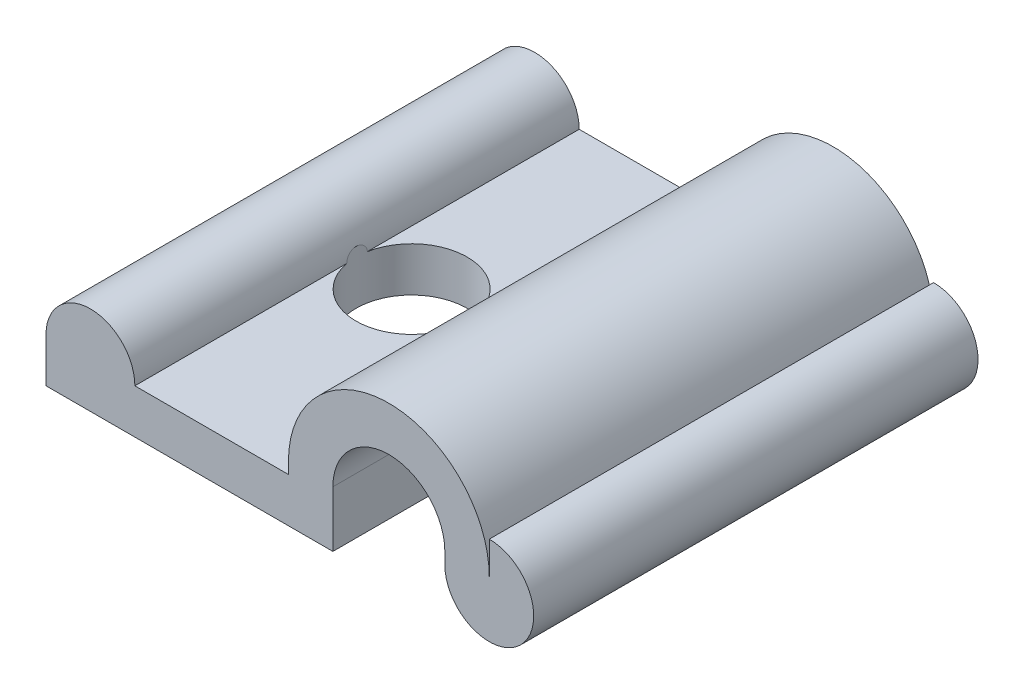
ISO-10303-21;
HEADER;
FILE_DESCRIPTION(('STEP AP214'),'2;1');
FILE_NAME('part.step','',(''),(''),'','','');
FILE_SCHEMA(('AUTOMOTIVE_DESIGN { 1 0 10303 214 1 1 1 1 }'));
ENDSEC;
DATA;
#1=APPLICATION_CONTEXT('core data for automotive mechanical design processes');
#2=APPLICATION_PROTOCOL_DEFINITION('international standard','automotive_design',2000,#1);
#3=PRODUCT_CONTEXT('',#1,'mechanical');
#4=PRODUCT('Part','Part','',(#3));
#5=PRODUCT_RELATED_PRODUCT_CATEGORY('part','',(#4));
#6=PRODUCT_DEFINITION_FORMATION('','',#4);
#7=PRODUCT_DEFINITION_CONTEXT('part definition',#1,'design');
#8=PRODUCT_DEFINITION('design','',#6,#7);
#9=PRODUCT_DEFINITION_SHAPE('','',#8);
#10=(LENGTH_UNIT() NAMED_UNIT(*) SI_UNIT(.MILLI.,.METRE.));
#11=(NAMED_UNIT(*) PLANE_ANGLE_UNIT() SI_UNIT($,.RADIAN.));
#12=(NAMED_UNIT(*) SI_UNIT($,.STERADIAN.) SOLID_ANGLE_UNIT());
#13=UNCERTAINTY_MEASURE_WITH_UNIT(LENGTH_MEASURE(1.E-05),#10,'distance_accuracy_value','');
#14=(GEOMETRIC_REPRESENTATION_CONTEXT(3) GLOBAL_UNCERTAINTY_ASSIGNED_CONTEXT((#13)) GLOBAL_UNIT_ASSIGNED_CONTEXT((#10,
#11,#12)) REPRESENTATION_CONTEXT('',''));
#15=CARTESIAN_POINT('',(0.,0.,0.));
#16=DIRECTION('',(0.,0.,1.));
#17=DIRECTION('',(1.,0.,0.));
#18=AXIS2_PLACEMENT_3D('',#15,#16,#17);
#19=CARTESIAN_POINT('',(-3.2,-3.2,12.7));
#20=DIRECTION('',(0.,1.,0.));
#21=DIRECTION('',(-1.,0.,0.));
#22=AXIS2_PLACEMENT_3D('',#19,#20,#21);
#23=PLANE('',#22);
#24=CARTESIAN_POINT('',(-11.4,-3.2,0.));
#25=DIRECTION('',(0.,-1.,0.));
#26=DIRECTION('',(1.,0.,0.));
#27=AXIS2_PLACEMENT_3D('',#24,#25,#26);
#28=CIRCLE('',#27,3.175);
#29=CARTESIAN_POINT('',(-8.225,-3.2,0.));
#30=VERTEX_POINT('',#29);
#31=EDGE_CURVE('E251',#30,#30,#28,.T.);
#32=ORIENTED_EDGE('',*,*,#31,.F.);
#33=EDGE_LOOP('',(#32));
#34=FACE_BOUND('',#33,.T.);
#35=DIRECTION('',(1.,0.,0.));
#36=VECTOR('',#35,1.);
#37=CARTESIAN_POINT('',(-3.2,-3.2,-12.7));
#38=LINE('',#37,#36);
#39=CARTESIAN_POINT('',(-19.6,-3.2,-12.7));
#40=VERTEX_POINT('',#39);
#41=CARTESIAN_POINT('',(-3.2,-3.2,-12.7));
#42=VERTEX_POINT('',#41);
#43=EDGE_CURVE('E161',#40,#42,#38,.T.);
#44=ORIENTED_EDGE('',*,*,#43,.T.);
#45=DIRECTION('',(0.,0.,-1.));
#46=VECTOR('',#45,1.);
#47=CARTESIAN_POINT('',(-3.2,-3.2,12.7));
#48=LINE('',#47,#46);
#49=CARTESIAN_POINT('',(-3.2,-3.2,12.7));
#50=VERTEX_POINT('',#49);
#51=EDGE_CURVE('E46',#50,#42,#48,.T.);
#52=ORIENTED_EDGE('',*,*,#51,.F.);
#53=DIRECTION('',(1.,0.,0.));
#54=VECTOR('',#53,1.);
#55=CARTESIAN_POINT('',(-3.2,-3.2,12.7));
#56=LINE('',#55,#54);
#57=CARTESIAN_POINT('',(-19.6,-3.2,12.7));
#58=VERTEX_POINT('',#57);
#59=EDGE_CURVE('E184',#58,#50,#56,.T.);
#60=ORIENTED_EDGE('',*,*,#59,.F.);
#61=DIRECTION('',(0.,0.,-1.));
#62=VECTOR('',#61,1.);
#63=CARTESIAN_POINT('',(-19.6,-3.2,12.7));
#64=LINE('',#63,#62);
#65=EDGE_CURVE('E157',#58,#40,#64,.T.);
#66=ORIENTED_EDGE('',*,*,#65,.T.);
#67=EDGE_LOOP('',(#44,#52,#60,#66));
#68=FACE_BOUND('',#67,.T.);
#69=ADVANCED_FACE('F34',(#34,#68),#23,.F.);
#70=CARTESIAN_POINT('',(-3.2,0.,12.7));
#71=DIRECTION('',(-1.,0.,0.));
#72=DIRECTION('',(0.,-1.,0.));
#73=AXIS2_PLACEMENT_3D('',#70,#71,#72);
#74=PLANE('',#73);
#75=DIRECTION('',(0.,1.,0.));
#76=VECTOR('',#75,1.);
#77=CARTESIAN_POINT('',(-3.2,0.,-12.7));
#78=LINE('',#77,#76);
#79=CARTESIAN_POINT('',(-3.2,0.,-12.7));
#80=VERTEX_POINT('',#79);
#81=EDGE_CURVE('E164',#42,#80,#78,.T.);
#82=ORIENTED_EDGE('',*,*,#81,.T.);
#83=DIRECTION('',(0.,0.,-1.));
#84=VECTOR('',#83,1.);
#85=CARTESIAN_POINT('',(-3.2,0.,12.7));
#86=LINE('',#85,#84);
#87=CARTESIAN_POINT('',(-3.2,0.,12.7));
#88=VERTEX_POINT('',#87);
#89=EDGE_CURVE('E203',#88,#80,#86,.T.);
#90=ORIENTED_EDGE('',*,*,#89,.F.);
#91=DIRECTION('',(0.,1.,0.));
#92=VECTOR('',#91,1.);
#93=CARTESIAN_POINT('',(-3.2,0.,12.7));
#94=LINE('',#93,#92);
#95=EDGE_CURVE('E111',#50,#88,#94,.T.);
#96=ORIENTED_EDGE('',*,*,#95,.F.);
#97=ORIENTED_EDGE('',*,*,#51,.T.);
#98=EDGE_LOOP('',(#82,#90,#96,#97));
#99=FACE_BOUND('',#98,.T.);
#100=ADVANCED_FACE('F206',(#99),#74,.F.);
#101=CARTESIAN_POINT('',(0.,0.,12.7));
#102=DIRECTION('',(0.,0.,-1.));
#103=DIRECTION('',(-1.,0.,0.));
#104=AXIS2_PLACEMENT_3D('',#101,#102,#103);
#105=CYLINDRICAL_SURFACE('',#104,3.2);
#106=CARTESIAN_POINT('',(0.,0.,-12.7));
#107=DIRECTION('',(0.,0.,-1.));
#108=DIRECTION('',(1.,0.,0.));
#109=AXIS2_PLACEMENT_3D('',#106,#107,#108);
#110=CIRCLE('',#109,3.2);
#111=CARTESIAN_POINT('',(3.2,0.,-12.7));
#112=VERTEX_POINT('',#111);
#113=EDGE_CURVE('E166',#80,#112,#110,.T.);
#114=ORIENTED_EDGE('',*,*,#113,.T.);
#115=DIRECTION('',(0.,0.,-1.));
#116=VECTOR('',#115,1.);
#117=CARTESIAN_POINT('',(3.2,0.,12.7));
#118=LINE('',#117,#116);
#119=CARTESIAN_POINT('',(3.2,0.,12.7));
#120=VERTEX_POINT('',#119);
#121=EDGE_CURVE('E200',#120,#112,#118,.T.);
#122=ORIENTED_EDGE('',*,*,#121,.F.);
#123=CARTESIAN_POINT('',(0.,0.,12.7));
#124=DIRECTION('',(0.,0.,-1.));
#125=DIRECTION('',(1.,0.,0.));
#126=AXIS2_PLACEMENT_3D('',#123,#124,#125);
#127=CIRCLE('',#126,3.2);
#128=EDGE_CURVE('E227',#88,#120,#127,.T.);
#129=ORIENTED_EDGE('',*,*,#128,.F.);
#130=ORIENTED_EDGE('',*,*,#89,.T.);
#131=EDGE_LOOP('',(#114,#122,#129,#130));
#132=FACE_BOUND('',#131,.T.);
#133=ADVANCED_FACE('F218',(#132),#105,.F.);
#134=CARTESIAN_POINT('',(3.2,0.,12.7));
#135=DIRECTION('',(1.,0.,0.));
#136=DIRECTION('',(0.,0.,-1.));
#137=AXIS2_PLACEMENT_3D('',#134,#135,#136);
#138=PLANE('',#137);
#139=DIRECTION('',(0.,-1.,0.));
#140=VECTOR('',#139,1.);
#141=CARTESIAN_POINT('',(3.2,0.,-12.7));
#142=LINE('',#141,#140);
#143=CARTESIAN_POINT('',(3.2,-0.659999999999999,-12.7));
#144=VERTEX_POINT('',#143);
#145=EDGE_CURVE('E168',#112,#144,#142,.T.);
#146=ORIENTED_EDGE('',*,*,#145,.T.);
#147=DIRECTION('',(0.,0.,-1.));
#148=VECTOR('',#147,1.);
#149=CARTESIAN_POINT('',(3.2,-0.659999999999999,12.7));
#150=LINE('',#149,#148);
#151=CARTESIAN_POINT('',(3.2,-0.659999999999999,12.7));
#152=VERTEX_POINT('',#151);
#153=EDGE_CURVE('E197',#152,#144,#150,.T.);
#154=ORIENTED_EDGE('',*,*,#153,.F.);
#155=DIRECTION('',(0.,-1.,0.));
#156=VECTOR('',#155,1.);
#157=CARTESIAN_POINT('',(3.2,0.,12.7));
#158=LINE('',#157,#156);
#159=EDGE_CURVE('E224',#120,#152,#158,.T.);
#160=ORIENTED_EDGE('',*,*,#159,.F.);
#161=ORIENTED_EDGE('',*,*,#121,.T.);
#162=EDGE_LOOP('',(#146,#154,#160,#161));
#163=FACE_BOUND('',#162,.T.);
#164=ADVANCED_FACE('F222',(#163),#138,.F.);
#165=CARTESIAN_POINT('',(5.74,-0.659999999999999,12.7));
#166=DIRECTION('',(0.,0.,-1.));
#167=DIRECTION('',(-1.,0.,0.));
#168=AXIS2_PLACEMENT_3D('',#165,#166,#167);
#169=CYLINDRICAL_SURFACE('',#168,2.54);
#170=CARTESIAN_POINT('',(5.74,-0.659999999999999,-12.7));
#171=DIRECTION('',(0.,0.,1.));
#172=DIRECTION('',(1.,0.,0.));
#173=AXIS2_PLACEMENT_3D('',#170,#171,#172);
#174=CIRCLE('',#173,2.54);
#175=CARTESIAN_POINT('',(5.74,1.88,-12.7));
#176=VERTEX_POINT('',#175);
#177=EDGE_CURVE('E170',#144,#176,#174,.T.);
#178=ORIENTED_EDGE('',*,*,#177,.T.);
#179=DIRECTION('',(0.,0.,-1.));
#180=VECTOR('',#179,1.);
#181=CARTESIAN_POINT('',(5.74,1.88,12.7));
#182=LINE('',#181,#180);
#183=CARTESIAN_POINT('',(5.74,1.88,12.7));
#184=VERTEX_POINT('',#183);
#185=EDGE_CURVE('E194',#184,#176,#182,.T.);
#186=ORIENTED_EDGE('',*,*,#185,.F.);
#187=CARTESIAN_POINT('',(5.74,-0.659999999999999,12.7));
#188=DIRECTION('',(0.,0.,1.));
#189=DIRECTION('',(1.,0.,0.));
#190=AXIS2_PLACEMENT_3D('',#187,#188,#189);
#191=CIRCLE('',#190,2.54);
#192=EDGE_CURVE('E226',#152,#184,#191,.T.);
#193=ORIENTED_EDGE('',*,*,#192,.F.);
#194=ORIENTED_EDGE('',*,*,#153,.T.);
#195=EDGE_LOOP('',(#178,#186,#193,#194));
#196=FACE_BOUND('',#195,.T.);
#197=ADVANCED_FACE('F268',(#196),#169,.T.);
#198=CARTESIAN_POINT('',(5.74,0.,12.7));
#199=DIRECTION('',(1.,0.,0.));
#200=DIRECTION('',(0.,0.,-1.));
#201=AXIS2_PLACEMENT_3D('',#198,#199,#200);
#202=PLANE('',#201);
#203=DIRECTION('',(0.,-1.,0.));
#204=VECTOR('',#203,1.);
#205=CARTESIAN_POINT('',(5.74,0.,-12.7));
#206=LINE('',#205,#204);
#207=CARTESIAN_POINT('',(5.74,0.,-12.7));
#208=VERTEX_POINT('',#207);
#209=EDGE_CURVE('E172',#176,#208,#206,.T.);
#210=ORIENTED_EDGE('',*,*,#209,.T.);
#211=DIRECTION('',(0.,0.,-1.));
#212=VECTOR('',#211,1.);
#213=CARTESIAN_POINT('',(5.74,0.,12.7));
#214=LINE('',#213,#212);
#215=CARTESIAN_POINT('',(5.74,0.,12.7));
#216=VERTEX_POINT('',#215);
#217=EDGE_CURVE('E191',#216,#208,#214,.T.);
#218=ORIENTED_EDGE('',*,*,#217,.F.);
#219=DIRECTION('',(0.,-1.,0.));
#220=VECTOR('',#219,1.);
#221=CARTESIAN_POINT('',(5.74,0.,12.7));
#222=LINE('',#221,#220);
#223=EDGE_CURVE('E229',#184,#216,#222,.T.);
#224=ORIENTED_EDGE('',*,*,#223,.F.);
#225=ORIENTED_EDGE('',*,*,#185,.T.);
#226=EDGE_LOOP('',(#210,#218,#224,#225));
#227=FACE_BOUND('',#226,.T.);
#228=ADVANCED_FACE('F271',(#227),#202,.F.);
#229=CARTESIAN_POINT('',(0.,0.,12.7));
#230=DIRECTION('',(0.,0.,-1.));
#231=DIRECTION('',(-1.,0.,0.));
#232=AXIS2_PLACEMENT_3D('',#229,#230,#231);
#233=CYLINDRICAL_SURFACE('',#232,5.74);
#234=CARTESIAN_POINT('',(0.,0.,-12.7));
#235=DIRECTION('',(0.,0.,1.));
#236=DIRECTION('',(1.,0.,0.));
#237=AXIS2_PLACEMENT_3D('',#234,#235,#236);
#238=CIRCLE('',#237,5.74);
#239=CARTESIAN_POINT('',(-5.74,0.,-12.7));
#240=VERTEX_POINT('',#239);
#241=EDGE_CURVE('E174',#208,#240,#238,.T.);
#242=ORIENTED_EDGE('',*,*,#241,.T.);
#243=DIRECTION('',(0.,0.,-1.));
#244=VECTOR('',#243,1.);
#245=CARTESIAN_POINT('',(-5.74,0.,12.7));
#246=LINE('',#245,#244);
#247=CARTESIAN_POINT('',(-5.74,0.,12.7));
#248=VERTEX_POINT('',#247);
#249=EDGE_CURVE('E188',#248,#240,#246,.T.);
#250=ORIENTED_EDGE('',*,*,#249,.F.);
#251=CARTESIAN_POINT('',(0.,0.,12.7));
#252=DIRECTION('',(0.,0.,1.));
#253=DIRECTION('',(1.,0.,0.));
#254=AXIS2_PLACEMENT_3D('',#251,#252,#253);
#255=CIRCLE('',#254,5.74);
#256=EDGE_CURVE('E235',#216,#248,#255,.T.);
#257=ORIENTED_EDGE('',*,*,#256,.F.);
#258=ORIENTED_EDGE('',*,*,#217,.T.);
#259=EDGE_LOOP('',(#242,#250,#257,#258));
#260=FACE_BOUND('',#259,.T.);
#261=ADVANCED_FACE('F241',(#260),#233,.T.);
#262=CARTESIAN_POINT('',(-5.74,0.,12.7));
#263=DIRECTION('',(1.,0.,0.));
#264=DIRECTION('',(0.,0.,-1.));
#265=AXIS2_PLACEMENT_3D('',#262,#263,#264);
#266=PLANE('',#265);
#267=DIRECTION('',(0.,-1.,0.));
#268=VECTOR('',#267,1.);
#269=CARTESIAN_POINT('',(-5.74,0.,-12.7));
#270=LINE('',#269,#268);
#271=CARTESIAN_POINT('',(-5.74,-0.660000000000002,-12.7));
#272=VERTEX_POINT('',#271);
#273=EDGE_CURVE('E176',#240,#272,#270,.T.);
#274=ORIENTED_EDGE('',*,*,#273,.T.);
#275=DIRECTION('',(0.,0.,-1.));
#276=VECTOR('',#275,1.);
#277=CARTESIAN_POINT('',(-5.74,-0.660000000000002,12.7));
#278=LINE('',#277,#276);
#279=CARTESIAN_POINT('',(-5.74,-0.660000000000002,12.7));
#280=VERTEX_POINT('',#279);
#281=EDGE_CURVE('E151',#280,#272,#278,.T.);
#282=ORIENTED_EDGE('',*,*,#281,.F.);
#283=DIRECTION('',(0.,-1.,0.));
#284=VECTOR('',#283,1.);
#285=CARTESIAN_POINT('',(-5.74,0.,12.7));
#286=LINE('',#285,#284);
#287=EDGE_CURVE('E141',#248,#280,#286,.T.);
#288=ORIENTED_EDGE('',*,*,#287,.F.);
#289=ORIENTED_EDGE('',*,*,#249,.T.);
#290=EDGE_LOOP('',(#274,#282,#288,#289));
#291=FACE_BOUND('',#290,.T.);
#292=ADVANCED_FACE('F245',(#291),#266,.F.);
#293=CARTESIAN_POINT('',(-14.52,-0.660000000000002,12.7));
#294=DIRECTION('',(0.,-1.,0.));
#295=DIRECTION('',(0.,0.,-1.));
#296=AXIS2_PLACEMENT_3D('',#293,#294,#295);
#297=PLANE('',#296);
#298=DIRECTION('',(0.,0.,-1.));
#299=VECTOR('',#298,1.);
#300=CARTESIAN_POINT('',(-14.52,-0.660000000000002,12.7));
#301=LINE('',#300,#299);
#302=CARTESIAN_POINT('',(-14.52,-0.660000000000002,-0.588408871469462));
#303=VERTEX_POINT('',#302);
#304=CARTESIAN_POINT('',(-14.52,-0.660000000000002,-12.7));
#305=VERTEX_POINT('',#304);
#306=EDGE_CURVE('E152',#303,#305,#301,.T.);
#307=ORIENTED_EDGE('',*,*,#306,.F.);
#308=CARTESIAN_POINT('',(-11.4,-0.660000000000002,0.));
#309=DIRECTION('',(0.,-1.,0.));
#310=DIRECTION('',(0.,0.,-1.));
#311=AXIS2_PLACEMENT_3D('',#308,#309,#310);
#312=CIRCLE('',#311,3.175);
#313=CARTESIAN_POINT('',(-14.52,-0.660000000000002,0.588408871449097));
#314=VERTEX_POINT('',#313);
#315=EDGE_CURVE('E52',#303,#314,#312,.T.);
#316=ORIENTED_EDGE('',*,*,#315,.T.);
#317=CARTESIAN_POINT('',(-14.52,-0.660000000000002,12.7));
#318=VERTEX_POINT('',#317);
#319=EDGE_CURVE('E147',#318,#314,#301,.T.);
#320=ORIENTED_EDGE('',*,*,#319,.F.);
#321=DIRECTION('',(-1.,0.,0.));
#322=VECTOR('',#321,1.);
#323=CARTESIAN_POINT('',(-14.52,-0.660000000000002,12.7));
#324=LINE('',#323,#322);
#325=EDGE_CURVE('E134',#280,#318,#324,.T.);
#326=ORIENTED_EDGE('',*,*,#325,.F.);
#327=ORIENTED_EDGE('',*,*,#281,.T.);
#328=DIRECTION('',(-1.,0.,0.));
#329=VECTOR('',#328,1.);
#330=CARTESIAN_POINT('',(-14.52,-0.660000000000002,-12.7));
#331=LINE('',#330,#329);
#332=EDGE_CURVE('E178',#272,#305,#331,.T.);
#333=ORIENTED_EDGE('',*,*,#332,.T.);
#334=EDGE_LOOP('',(#307,#316,#320,#326,#327,#333));
#335=FACE_BOUND('',#334,.T.);
#336=ADVANCED_FACE('F149',(#335),#297,.F.);
#337=CARTESIAN_POINT('',(-17.06,-0.660000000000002,12.7));
#338=DIRECTION('',(0.,0.,-1.));
#339=DIRECTION('',(-1.,0.,0.));
#340=AXIS2_PLACEMENT_3D('',#337,#338,#339);
#341=CYLINDRICAL_SURFACE('',#340,2.54);
#342=ORIENTED_EDGE('',*,*,#319,.T.);
#343=CARTESIAN_POINT('',(-14.52,-0.660000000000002,0.588408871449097));
#344=CARTESIAN_POINT('',(-14.5199824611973,-0.632334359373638,0.588444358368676));
#345=CARTESIAN_POINT('',(-14.5204514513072,-0.604693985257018,0.586014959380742));
#346=CARTESIAN_POINT('',(-14.5222274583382,-0.550349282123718,0.576508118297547));
#347=CARTESIAN_POINT('',(-14.5235315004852,-0.52364198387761,0.569447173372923));
#348=CARTESIAN_POINT('',(-14.5268435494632,-0.471853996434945,0.55095977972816));
#349=CARTESIAN_POINT('',(-14.5288512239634,-0.44677254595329,0.539535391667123));
#350=CARTESIAN_POINT('',(-14.5333478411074,-0.398833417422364,0.512777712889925));
#351=CARTESIAN_POINT('',(-14.5358370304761,-0.375976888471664,0.4974424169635));
#352=CARTESIAN_POINT('',(-14.5411169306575,-0.332396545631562,0.462947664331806));
#353=CARTESIAN_POINT('',(-14.5439139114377,-0.311745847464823,0.443697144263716));
#354=CARTESIAN_POINT('',(-14.5494833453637,-0.273635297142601,0.402264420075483));
#355=CARTESIAN_POINT('',(-14.5522557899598,-0.256176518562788,0.380081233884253));
#356=CARTESIAN_POINT('',(-14.557793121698,-0.223113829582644,0.331106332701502));
#357=CARTESIAN_POINT('',(-14.5605306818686,-0.207858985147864,0.304076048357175));
#358=CARTESIAN_POINT('',(-14.5654261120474,-0.181586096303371,0.247984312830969));
#359=CARTESIAN_POINT('',(-14.5675837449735,-0.170569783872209,0.218922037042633));
#360=CARTESIAN_POINT('',(-14.5713136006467,-0.151924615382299,0.156430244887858));
#361=CARTESIAN_POINT('',(-14.5728034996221,-0.144756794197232,0.12285788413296));
#362=CARTESIAN_POINT('',(-14.5747058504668,-0.13565831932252,0.0549764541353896));
#363=CARTESIAN_POINT('',(-14.5751178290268,-0.133729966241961,0.0206670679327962));
#364=CARTESIAN_POINT('',(-14.574814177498,-0.135163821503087,-0.0501377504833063));
#365=CARTESIAN_POINT('',(-14.5740214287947,-0.13888783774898,-0.0866262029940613));
#366=CARTESIAN_POINT('',(-14.5712472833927,-0.152302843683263,-0.15845535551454));
#367=CARTESIAN_POINT('',(-14.5692656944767,-0.161994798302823,-0.193795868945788));
#368=CARTESIAN_POINT('',(-14.5643471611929,-0.187261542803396,-0.262107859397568));
#369=CARTESIAN_POINT('',(-14.5614136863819,-0.202815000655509,-0.295087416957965));
#370=CARTESIAN_POINT('',(-14.5549522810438,-0.239662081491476,-0.357615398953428));
#371=CARTESIAN_POINT('',(-14.5514246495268,-0.260952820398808,-0.387165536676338));
#372=CARTESIAN_POINT('',(-14.5445497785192,-0.307002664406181,-0.439399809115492));
#373=CARTESIAN_POINT('',(-14.541210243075,-0.331355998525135,-0.462441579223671));
#374=CARTESIAN_POINT('',(-14.5348950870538,-0.384056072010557,-0.503478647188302));
#375=CARTESIAN_POINT('',(-14.5319192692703,-0.412400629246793,-0.521476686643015));
#376=CARTESIAN_POINT('',(-14.5270658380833,-0.468806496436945,-0.549788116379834));
#377=CARTESIAN_POINT('',(-14.5251024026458,-0.496541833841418,-0.560737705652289));
#378=CARTESIAN_POINT('',(-14.5220730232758,-0.553549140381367,-0.577374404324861));
#379=CARTESIAN_POINT('',(-14.5210049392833,-0.582817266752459,-0.583074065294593));
#380=CARTESIAN_POINT('',(-14.5201478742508,-0.628182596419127,-0.587620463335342));
#381=CARTESIAN_POINT('',(-14.519995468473,-0.644095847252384,-0.588419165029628));
#382=CARTESIAN_POINT('',(-14.5199999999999,-0.659999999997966,-0.588408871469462));
#383=B_SPLINE_CURVE_WITH_KNOTS('',3,(#343,#344,#345,#346,#347,#348,#349,#350,#351,#352,#353,
#354,#355,#356,#357,#358,#359,#360,#361,#362,#363,#364,#365,#366,#367,#368,#369,#370,#371,#372,
#373,#374,#375,#376,#377,#378,#379,#380,#381,#382),.UNSPECIFIED.,.F.,.F.,(4,2,2,2,2,2,2,2,2,2,2,
2,2,2,2,2,2,2,2,4),(0.,0.0828470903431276,0.165400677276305,0.247915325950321,0.330472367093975,
0.415230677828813,0.500017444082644,0.593107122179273,0.686234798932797,0.788876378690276,
0.891563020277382,1.0011053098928,1.11066531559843,1.21983038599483,1.32894068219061,
1.42944892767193,1.52990243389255,1.61906973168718,1.70802329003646,1.75574089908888),.UNSPECIFIED.);
#384=EDGE_CURVE('E11',#314,#303,#383,.T.);
#385=ORIENTED_EDGE('',*,*,#384,.T.);
#386=ORIENTED_EDGE('',*,*,#306,.T.);
#387=CARTESIAN_POINT('',(-17.06,-0.660000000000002,-12.7));
#388=DIRECTION('',(0.,0.,1.));
#389=DIRECTION('',(1.,0.,0.));
#390=AXIS2_PLACEMENT_3D('',#387,#388,#389);
#391=CIRCLE('',#390,2.54);
#392=CARTESIAN_POINT('',(-19.6,-0.660000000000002,-12.7));
#393=VERTEX_POINT('',#392);
#394=EDGE_CURVE('E181',#305,#393,#391,.T.);
#395=ORIENTED_EDGE('',*,*,#394,.T.);
#396=DIRECTION('',(0.,0.,-1.));
#397=VECTOR('',#396,1.);
#398=CARTESIAN_POINT('',(-19.6,-0.660000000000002,12.7));
#399=LINE('',#398,#397);
#400=CARTESIAN_POINT('',(-19.6,-0.660000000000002,12.7));
#401=VERTEX_POINT('',#400);
#402=EDGE_CURVE('E155',#401,#393,#399,.T.);
#403=ORIENTED_EDGE('',*,*,#402,.F.);
#404=CARTESIAN_POINT('',(-17.06,-0.660000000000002,12.7));
#405=DIRECTION('',(0.,0.,1.));
#406=DIRECTION('',(1.,0.,0.));
#407=AXIS2_PLACEMENT_3D('',#404,#405,#406);
#408=CIRCLE('',#407,2.54);
#409=EDGE_CURVE('E138',#318,#401,#408,.T.);
#410=ORIENTED_EDGE('',*,*,#409,.F.);
#411=EDGE_LOOP('',(#342,#385,#386,#395,#403,#410));
#412=FACE_BOUND('',#411,.T.);
#413=ADVANCED_FACE('F154',(#412),#341,.T.);
#414=CARTESIAN_POINT('',(-19.6,-3.2,12.7));
#415=DIRECTION('',(1.,0.,0.));
#416=DIRECTION('',(0.,0.,-1.));
#417=AXIS2_PLACEMENT_3D('',#414,#415,#416);
#418=PLANE('',#417);
#419=DIRECTION('',(0.,-1.,0.));
#420=VECTOR('',#419,1.);
#421=CARTESIAN_POINT('',(-19.6,-3.2,-12.7));
#422=LINE('',#421,#420);
#423=EDGE_CURVE('E102',#393,#40,#422,.T.);
#424=ORIENTED_EDGE('',*,*,#423,.T.);
#425=ORIENTED_EDGE('',*,*,#65,.F.);
#426=DIRECTION('',(0.,-1.,0.));
#427=VECTOR('',#426,1.);
#428=CARTESIAN_POINT('',(-19.6,-3.2,12.7));
#429=LINE('',#428,#427);
#430=EDGE_CURVE('E60',#401,#58,#429,.T.);
#431=ORIENTED_EDGE('',*,*,#430,.F.);
#432=ORIENTED_EDGE('',*,*,#402,.T.);
#433=EDGE_LOOP('',(#424,#425,#431,#432));
#434=FACE_BOUND('',#433,.T.);
#435=ADVANCED_FACE('F247',(#434),#418,.F.);
#436=CARTESIAN_POINT('',(-17.06,-0.660000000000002,12.7));
#437=DIRECTION('',(0.,0.,1.));
#438=DIRECTION('',(1.,0.,0.));
#439=AXIS2_PLACEMENT_3D('',#436,#437,#438);
#440=PLANE('',#439);
#441=ORIENTED_EDGE('',*,*,#59,.T.);
#442=ORIENTED_EDGE('',*,*,#95,.T.);
#443=ORIENTED_EDGE('',*,*,#128,.T.);
#444=ORIENTED_EDGE('',*,*,#159,.T.);
#445=ORIENTED_EDGE('',*,*,#192,.T.);
#446=ORIENTED_EDGE('',*,*,#223,.T.);
#447=ORIENTED_EDGE('',*,*,#256,.T.);
#448=ORIENTED_EDGE('',*,*,#287,.T.);
#449=ORIENTED_EDGE('',*,*,#325,.T.);
#450=ORIENTED_EDGE('',*,*,#409,.T.);
#451=ORIENTED_EDGE('',*,*,#430,.T.);
#452=EDGE_LOOP('',(#441,#442,#443,#444,#445,#446,#447,#448,#449,#450,#451));
#453=FACE_BOUND('',#452,.T.);
#454=ADVANCED_FACE('F136',(#453),#440,.T.);
#455=CARTESIAN_POINT('',(-17.06,-0.660000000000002,-12.7));
#456=DIRECTION('',(0.,0.,1.));
#457=DIRECTION('',(1.,0.,0.));
#458=AXIS2_PLACEMENT_3D('',#455,#456,#457);
#459=PLANE('',#458);
#460=ORIENTED_EDGE('',*,*,#43,.F.);
#461=ORIENTED_EDGE('',*,*,#423,.F.);
#462=ORIENTED_EDGE('',*,*,#394,.F.);
#463=ORIENTED_EDGE('',*,*,#332,.F.);
#464=ORIENTED_EDGE('',*,*,#273,.F.);
#465=ORIENTED_EDGE('',*,*,#241,.F.);
#466=ORIENTED_EDGE('',*,*,#209,.F.);
#467=ORIENTED_EDGE('',*,*,#177,.F.);
#468=ORIENTED_EDGE('',*,*,#145,.F.);
#469=ORIENTED_EDGE('',*,*,#113,.F.);
#470=ORIENTED_EDGE('',*,*,#81,.F.);
#471=EDGE_LOOP('',(#460,#461,#462,#463,#464,#465,#466,#467,#468,#469,#470));
#472=FACE_BOUND('',#471,.T.);
#473=ADVANCED_FACE('F211',(#472),#459,.F.);
#474=CARTESIAN_POINT('',(-11.4,5.74,0.));
#475=DIRECTION('',(0.,-1.,0.));
#476=DIRECTION('',(1.,0.,0.));
#477=AXIS2_PLACEMENT_3D('',#474,#475,#476);
#478=CYLINDRICAL_SURFACE('',#477,3.175);
#479=ORIENTED_EDGE('',*,*,#31,.T.);
#480=EDGE_LOOP('',(#479));
#481=FACE_BOUND('',#480,.T.);
#482=ORIENTED_EDGE('',*,*,#384,.F.);
#483=ORIENTED_EDGE('',*,*,#315,.F.);
#484=EDGE_LOOP('',(#482,#483));
#485=FACE_BOUND('',#484,.T.);
#486=ADVANCED_FACE('F255',(#481,#485),#478,.F.);
#487=CLOSED_SHELL('',(#69,#100,#133,#164,#197,#228,#261,#292,#336,#413,#435,#454,#473,#486));
#488=MANIFOLD_SOLID_BREP('B2',#487);
#489=ADVANCED_BREP_SHAPE_REPRESENTATION('',(#18,#488),#14);
#490=SHAPE_DEFINITION_REPRESENTATION(#9,#489);
ENDSEC;
END-ISO-10303-21;
